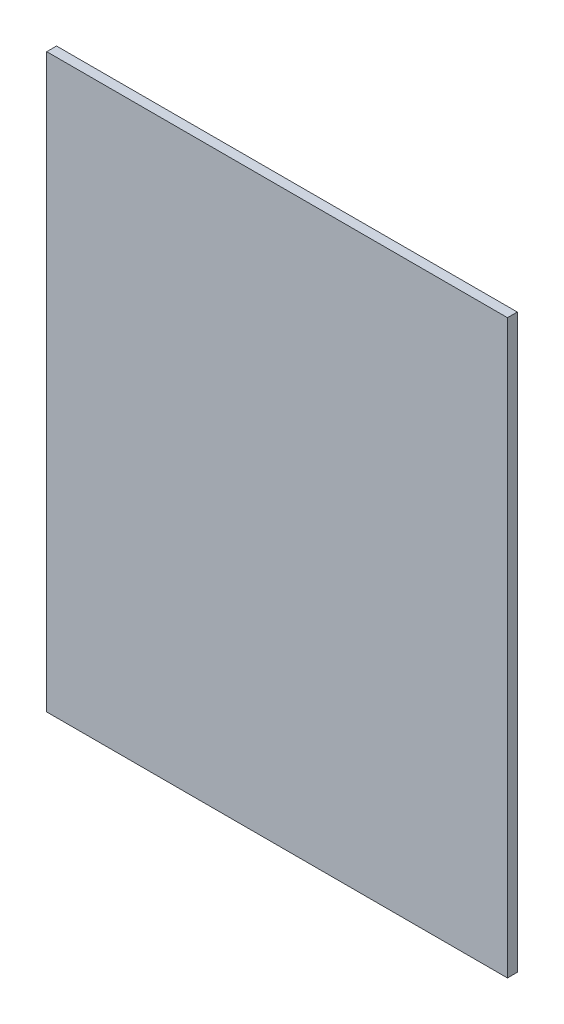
from build123d import *

# Parameters (mm, degrees)
SKETCH1_W           = 141
SKETCH1_H           = 175
BOSS_EXTRUDE1_DEPTH = 3


with BuildPart() as part:
    # Sketch1 → Boss-Extrude1 (new body)
    with BuildSketch(Plane.XY):
        Rectangle(SKETCH1_W, SKETCH1_H)
    extrude(amount=BOSS_EXTRUDE1_DEPTH)


solid = part.part
